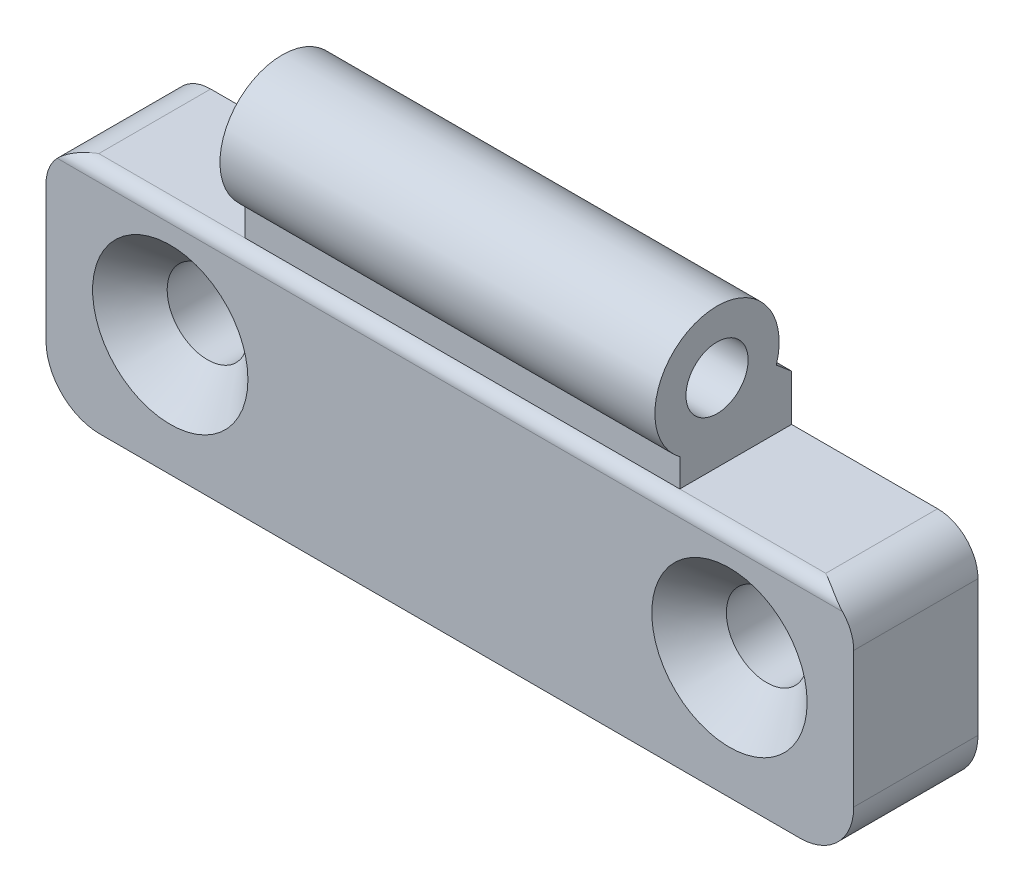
ISO-10303-21;
HEADER;
FILE_DESCRIPTION(('STEP AP214'),'2;1');
FILE_NAME('part.step','',(''),(''),'','','');
FILE_SCHEMA(('AUTOMOTIVE_DESIGN { 1 0 10303 214 1 1 1 1 }'));
ENDSEC;
DATA;
#1=APPLICATION_CONTEXT('core data for automotive mechanical design processes');
#2=APPLICATION_PROTOCOL_DEFINITION('international standard','automotive_design',2000,#1);
#3=PRODUCT_CONTEXT('',#1,'mechanical');
#4=PRODUCT('Part','Part','',(#3));
#5=PRODUCT_RELATED_PRODUCT_CATEGORY('part','',(#4));
#6=PRODUCT_DEFINITION_FORMATION('','',#4);
#7=PRODUCT_DEFINITION_CONTEXT('part definition',#1,'design');
#8=PRODUCT_DEFINITION('design','',#6,#7);
#9=PRODUCT_DEFINITION_SHAPE('','',#8);
#10=(LENGTH_UNIT() NAMED_UNIT(*) SI_UNIT(.MILLI.,.METRE.));
#11=(NAMED_UNIT(*) PLANE_ANGLE_UNIT() SI_UNIT($,.RADIAN.));
#12=(NAMED_UNIT(*) SI_UNIT($,.STERADIAN.) SOLID_ANGLE_UNIT());
#13=UNCERTAINTY_MEASURE_WITH_UNIT(LENGTH_MEASURE(1.E-05),#10,'distance_accuracy_value','');
#14=(GEOMETRIC_REPRESENTATION_CONTEXT(3) GLOBAL_UNCERTAINTY_ASSIGNED_CONTEXT((#13)) GLOBAL_UNIT_ASSIGNED_CONTEXT((#10,
#11,#12)) REPRESENTATION_CONTEXT('',''));
#15=CARTESIAN_POINT('',(0.,0.,0.));
#16=DIRECTION('',(0.,0.,1.));
#17=DIRECTION('',(1.,0.,0.));
#18=AXIS2_PLACEMENT_3D('',#15,#16,#17);
#19=CARTESIAN_POINT('',(0.,0.,9.99999999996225));
#20=DIRECTION('',(0.,0.,1.));
#21=DIRECTION('',(1.,0.,0.));
#22=AXIS2_PLACEMENT_3D('',#19,#20,#21);
#23=CONICAL_SURFACE('',#22,6.24999999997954,0.785398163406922);
#24=CARTESIAN_POINT('',(0.,0.,9.99999999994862));
#25=DIRECTION('',(0.,0.,1.));
#26=DIRECTION('',(1.,0.,0.));
#27=AXIS2_PLACEMENT_3D('',#24,#25,#26);
#28=CIRCLE('',#27,6.24999999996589);
#29=CARTESIAN_POINT('',(6.24999999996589,0.,9.99999999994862));
#30=VERTEX_POINT('',#29);
#31=EDGE_CURVE('E17',#30,#30,#28,.F.);
#32=ORIENTED_EDGE('',*,*,#31,.F.);
#33=EDGE_LOOP('',(#32));
#34=FACE_BOUND('',#33,.T.);
#35=CARTESIAN_POINT('',(0.,0.,7.));
#36=DIRECTION('',(0.,0.,-1.));
#37=DIRECTION('',(-1.,0.,0.));
#38=AXIS2_PLACEMENT_3D('',#35,#36,#37);
#39=CIRCLE('',#38,3.25);
#40=CARTESIAN_POINT('',(-3.25,0.,7.));
#41=VERTEX_POINT('',#40);
#42=EDGE_CURVE('E152',#41,#41,#39,.T.);
#43=ORIENTED_EDGE('',*,*,#42,.T.);
#44=EDGE_LOOP('',(#43));
#45=FACE_BOUND('',#44,.T.);
#46=ADVANCED_FACE('F14',(#34,#45),#23,.F.);
#47=CARTESIAN_POINT('',(45.,0.,9.99999999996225));
#48=DIRECTION('',(0.,0.,1.));
#49=DIRECTION('',(1.,0.,0.));
#50=AXIS2_PLACEMENT_3D('',#47,#48,#49);
#51=CONICAL_SURFACE('',#50,6.24999999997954,0.785398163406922);
#52=CARTESIAN_POINT('',(45.,0.,9.99999999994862));
#53=DIRECTION('',(0.,0.,1.));
#54=DIRECTION('',(1.,0.,0.));
#55=AXIS2_PLACEMENT_3D('',#52,#53,#54);
#56=CIRCLE('',#55,6.24999999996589);
#57=CARTESIAN_POINT('',(51.2499999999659,0.,9.99999999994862));
#58=VERTEX_POINT('',#57);
#59=EDGE_CURVE('E149',#58,#58,#56,.F.);
#60=ORIENTED_EDGE('',*,*,#59,.F.);
#61=EDGE_LOOP('',(#60));
#62=FACE_BOUND('',#61,.T.);
#63=CARTESIAN_POINT('',(45.,0.,7.));
#64=DIRECTION('',(0.,0.,-1.));
#65=DIRECTION('',(-1.,0.,0.));
#66=AXIS2_PLACEMENT_3D('',#63,#64,#65);
#67=CIRCLE('',#66,3.25);
#68=CARTESIAN_POINT('',(41.75,0.,7.));
#69=VERTEX_POINT('',#68);
#70=EDGE_CURVE('E175',#69,#69,#67,.T.);
#71=ORIENTED_EDGE('',*,*,#70,.T.);
#72=EDGE_LOOP('',(#71));
#73=FACE_BOUND('',#72,.T.);
#74=ADVANCED_FACE('F403',(#62,#73),#51,.F.);
#75=CARTESIAN_POINT('',(40.,15.,6.));
#76=DIRECTION('',(1.,0.,0.));
#77=DIRECTION('',(0.,1.,0.));
#78=AXIS2_PLACEMENT_3D('',#75,#76,#77);
#79=CYLINDRICAL_SURFACE('',#78,5.);
#80=DIRECTION('',(1.,0.,0.));
#81=VECTOR('',#80,1.);
#82=CARTESIAN_POINT('',(40.,11.,9.));
#83=LINE('',#82,#81);
#84=CARTESIAN_POINT('',(40.,11.,9.));
#85=VERTEX_POINT('',#84);
#86=CARTESIAN_POINT('',(5.,11.,9.));
#87=VERTEX_POINT('',#86);
#88=EDGE_CURVE('E108',#85,#87,#83,.F.);
#89=ORIENTED_EDGE('',*,*,#88,.F.);
#90=CARTESIAN_POINT('',(40.,15.,6.));
#91=DIRECTION('',(1.,0.,0.));
#92=DIRECTION('',(0.,1.,0.));
#93=AXIS2_PLACEMENT_3D('',#90,#91,#92);
#94=CIRCLE('',#93,5.);
#95=CARTESIAN_POINT('',(40.,13.5,1.23030399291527));
#96=VERTEX_POINT('',#95);
#97=EDGE_CURVE('E99',#96,#85,#94,.T.);
#98=ORIENTED_EDGE('',*,*,#97,.F.);
#99=DIRECTION('',(1.,0.,0.));
#100=VECTOR('',#99,1.);
#101=CARTESIAN_POINT('',(40.,13.5,1.23030399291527));
#102=LINE('',#101,#100);
#103=CARTESIAN_POINT('',(5.,13.5,1.23030399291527));
#104=VERTEX_POINT('',#103);
#105=EDGE_CURVE('E106',#104,#96,#102,.T.);
#106=ORIENTED_EDGE('',*,*,#105,.F.);
#107=CARTESIAN_POINT('',(5.,15.,6.));
#108=DIRECTION('',(1.,0.,0.));
#109=DIRECTION('',(0.,1.,0.));
#110=AXIS2_PLACEMENT_3D('',#107,#108,#109);
#111=CIRCLE('',#110,5.);
#112=EDGE_CURVE('E130',#104,#87,#111,.T.);
#113=ORIENTED_EDGE('',*,*,#112,.T.);
#114=EDGE_LOOP('',(#89,#98,#106,#113));
#115=FACE_BOUND('',#114,.T.);
#116=ADVANCED_FACE('F104',(#115),#79,.T.);
#117=CARTESIAN_POINT('',(40.,11.,9.));
#118=DIRECTION('',(0.,0.,1.));
#119=DIRECTION('',(1.,0.,0.));
#120=AXIS2_PLACEMENT_3D('',#117,#118,#119);
#121=PLANE('',#120);
#122=ORIENTED_EDGE('',*,*,#88,.T.);
#123=DIRECTION('',(0.,1.,0.));
#124=VECTOR('',#123,1.);
#125=CARTESIAN_POINT('',(5.,15.,9.));
#126=LINE('',#125,#124);
#127=CARTESIAN_POINT('',(5.,8.75,9.));
#128=VERTEX_POINT('',#127);
#129=EDGE_CURVE('E332',#87,#128,#126,.F.);
#130=ORIENTED_EDGE('',*,*,#129,.T.);
#131=DIRECTION('',(1.,0.,0.));
#132=VECTOR('',#131,1.);
#133=CARTESIAN_POINT('',(55.,8.75,9.));
#134=LINE('',#133,#132);
#135=CARTESIAN_POINT('',(40.,8.75,9.));
#136=VERTEX_POINT('',#135);
#137=EDGE_CURVE('E148',#136,#128,#134,.F.);
#138=ORIENTED_EDGE('',*,*,#137,.F.);
#139=DIRECTION('',(0.,1.,0.));
#140=VECTOR('',#139,1.);
#141=CARTESIAN_POINT('',(40.,15.,9.));
#142=LINE('',#141,#140);
#143=EDGE_CURVE('E110',#85,#136,#142,.F.);
#144=ORIENTED_EDGE('',*,*,#143,.F.);
#145=EDGE_LOOP('',(#122,#130,#138,#144));
#146=FACE_BOUND('',#145,.T.);
#147=ADVANCED_FACE('F350',(#146),#121,.T.);
#148=CARTESIAN_POINT('',(40.,15.,6.));
#149=DIRECTION('',(1.,0.,0.));
#150=DIRECTION('',(0.,1.,0.));
#151=AXIS2_PLACEMENT_3D('',#148,#149,#150);
#152=CYLINDRICAL_SURFACE('',#151,2.5);
#153=CARTESIAN_POINT('',(5.,15.,6.));
#154=DIRECTION('',(1.,0.,0.));
#155=DIRECTION('',(0.,1.,0.));
#156=AXIS2_PLACEMENT_3D('',#153,#154,#155);
#157=CIRCLE('',#156,2.5);
#158=CARTESIAN_POINT('',(5.,17.5,6.));
#159=VERTEX_POINT('',#158);
#160=EDGE_CURVE('E239',#159,#159,#157,.F.);
#161=ORIENTED_EDGE('',*,*,#160,.T.);
#162=EDGE_LOOP('',(#161));
#163=FACE_BOUND('',#162,.T.);
#164=CARTESIAN_POINT('',(40.,15.,6.));
#165=DIRECTION('',(1.,0.,0.));
#166=DIRECTION('',(0.,1.,0.));
#167=AXIS2_PLACEMENT_3D('',#164,#165,#166);
#168=CIRCLE('',#167,2.5);
#169=CARTESIAN_POINT('',(40.,17.5,6.));
#170=VERTEX_POINT('',#169);
#171=EDGE_CURVE('E111',#170,#170,#168,.F.);
#172=ORIENTED_EDGE('',*,*,#171,.F.);
#173=EDGE_LOOP('',(#172));
#174=FACE_BOUND('',#173,.T.);
#175=ADVANCED_FACE('F418',(#163,#174),#152,.F.);
#176=CARTESIAN_POINT('',(22.5,15.,10.));
#177=DIRECTION('',(0.,0.,1.));
#178=DIRECTION('',(1.,0.,0.));
#179=AXIS2_PLACEMENT_3D('',#176,#177,#178);
#180=PLANE('',#179);
#181=CARTESIAN_POINT('',(51.75,5.5,10.));
#182=DIRECTION('',(0.,0.,-1.));
#183=DIRECTION('',(-1.,0.,0.));
#184=AXIS2_PLACEMENT_3D('',#181,#182,#183);
#185=CIRCLE('',#184,3.25);
#186=CARTESIAN_POINT('',(54.0952078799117,7.75,10.));
#187=VERTEX_POINT('',#186);
#188=CARTESIAN_POINT('',(55.,5.5,10.));
#189=VERTEX_POINT('',#188);
#190=EDGE_CURVE('E201',#187,#189,#185,.T.);
#191=ORIENTED_EDGE('',*,*,#190,.F.);
#192=DIRECTION('',(1.,0.,0.));
#193=VECTOR('',#192,1.);
#194=CARTESIAN_POINT('',(55.,7.75,10.));
#195=LINE('',#194,#193);
#196=CARTESIAN_POINT('',(-9.0952078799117,7.75,10.));
#197=VERTEX_POINT('',#196);
#198=EDGE_CURVE('E146',#197,#187,#195,.T.);
#199=ORIENTED_EDGE('',*,*,#198,.F.);
#200=CARTESIAN_POINT('',(-6.75,5.5,10.));
#201=DIRECTION('',(0.,0.,-1.));
#202=DIRECTION('',(-1.,0.,0.));
#203=AXIS2_PLACEMENT_3D('',#200,#201,#202);
#204=CIRCLE('',#203,3.25);
#205=CARTESIAN_POINT('',(-10.,5.5,10.));
#206=VERTEX_POINT('',#205);
#207=EDGE_CURVE('E166',#206,#197,#204,.T.);
#208=ORIENTED_EDGE('',*,*,#207,.F.);
#209=DIRECTION('',(0.,-1.,0.));
#210=VECTOR('',#209,1.);
#211=CARTESIAN_POINT('',(-10.,-5.4166666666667,10.));
#212=LINE('',#211,#210);
#213=CARTESIAN_POINT('',(-10.,-5.4166666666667,10.));
#214=VERTEX_POINT('',#213);
#215=EDGE_CURVE('E163',#214,#206,#212,.F.);
#216=ORIENTED_EDGE('',*,*,#215,.F.);
#217=CARTESIAN_POINT('',(-5.6666666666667,-5.4166666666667,10.));
#218=DIRECTION('',(0.,0.,-1.));
#219=DIRECTION('',(-1.,0.,0.));
#220=AXIS2_PLACEMENT_3D('',#217,#218,#219);
#221=CIRCLE('',#220,4.33333333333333);
#222=CARTESIAN_POINT('',(-5.6666666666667,-9.75,10.));
#223=VERTEX_POINT('',#222);
#224=EDGE_CURVE('E321',#223,#214,#221,.T.);
#225=ORIENTED_EDGE('',*,*,#224,.F.);
#226=DIRECTION('',(1.,0.,0.));
#227=VECTOR('',#226,1.);
#228=CARTESIAN_POINT('',(50.6666666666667,-9.75,10.));
#229=LINE('',#228,#227);
#230=CARTESIAN_POINT('',(50.6666666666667,-9.75,10.));
#231=VERTEX_POINT('',#230);
#232=EDGE_CURVE('E159',#231,#223,#229,.F.);
#233=ORIENTED_EDGE('',*,*,#232,.F.);
#234=CARTESIAN_POINT('',(50.6666666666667,-5.4166666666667,10.));
#235=DIRECTION('',(0.,0.,-1.));
#236=DIRECTION('',(-1.,0.,0.));
#237=AXIS2_PLACEMENT_3D('',#234,#235,#236);
#238=CIRCLE('',#237,4.33333333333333);
#239=CARTESIAN_POINT('',(55.,-5.4166666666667,10.));
#240=VERTEX_POINT('',#239);
#241=EDGE_CURVE('E213',#240,#231,#238,.T.);
#242=ORIENTED_EDGE('',*,*,#241,.F.);
#243=DIRECTION('',(0.,1.,0.));
#244=VECTOR('',#243,1.);
#245=CARTESIAN_POINT('',(55.,5.5,10.));
#246=LINE('',#245,#244);
#247=EDGE_CURVE('E155',#189,#240,#246,.F.);
#248=ORIENTED_EDGE('',*,*,#247,.F.);
#249=EDGE_LOOP('',(#191,#199,#208,#216,#225,#233,#242,#248));
#250=FACE_BOUND('',#249,.T.);
#251=ORIENTED_EDGE('',*,*,#59,.T.);
#252=EDGE_LOOP('',(#251));
#253=FACE_BOUND('',#252,.T.);
#254=ORIENTED_EDGE('',*,*,#31,.T.);
#255=EDGE_LOOP('',(#254));
#256=FACE_BOUND('',#255,.T.);
#257=ADVANCED_FACE('F225',(#250,#253,#256),#180,.T.);
#258=CARTESIAN_POINT('',(55.,7.75,9.));
#259=DIRECTION('',(1.,0.,0.));
#260=DIRECTION('',(0.,1.,0.));
#261=AXIS2_PLACEMENT_3D('',#258,#259,#260);
#262=CYLINDRICAL_SURFACE('',#261,1.);
#263=ORIENTED_EDGE('',*,*,#137,.T.);
#264=DIRECTION('',(-1.,0.,0.));
#265=VECTOR('',#264,1.);
#266=CARTESIAN_POINT('',(-6.75,8.75,9.));
#267=LINE('',#266,#265);
#268=CARTESIAN_POINT('',(-6.75,8.75,9.));
#269=VERTEX_POINT('',#268);
#270=EDGE_CURVE('E167',#269,#128,#267,.F.);
#271=ORIENTED_EDGE('',*,*,#270,.F.);
#272=CARTESIAN_POINT('',(-9.0952078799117,7.75,10.));
#273=CARTESIAN_POINT('',(-9.05730541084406,7.7895153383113,9.9999877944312));
#274=CARTESIAN_POINT('',(-9.01844303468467,7.82801385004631,9.99766050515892));
#275=CARTESIAN_POINT('',(-8.9391426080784,7.90272925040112,9.98898430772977));
#276=CARTESIAN_POINT('',(-8.89870771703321,7.93895036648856,9.9826431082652));
#277=CARTESIAN_POINT('',(-8.77612768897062,8.04337299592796,9.95864810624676));
#278=CARTESIAN_POINT('',(-8.69196734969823,8.10810030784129,9.93599885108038));
#279=CARTESIAN_POINT('',(-8.54229248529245,8.21223956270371,9.88809834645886));
#280=CARTESIAN_POINT('',(-8.47756518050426,8.25387573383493,9.86502360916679));
#281=CARTESIAN_POINT('',(-8.34656824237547,8.33183254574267,9.81463038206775));
#282=CARTESIAN_POINT('',(-8.28029817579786,8.3681516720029,9.78731068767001));
#283=CARTESIAN_POINT('',(-8.07896601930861,8.46968556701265,9.70004516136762));
#284=CARTESIAN_POINT('',(-7.94205678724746,8.52701481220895,9.63502639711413));
#285=CARTESIAN_POINT('',(-7.71806304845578,8.60380340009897,9.52318018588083));
#286=CARTESIAN_POINT('',(-7.63173288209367,8.62938347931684,9.47878152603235));
#287=CARTESIAN_POINT('',(-7.45833118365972,8.67313159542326,9.38778607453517));
#288=CARTESIAN_POINT('',(-7.37125941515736,8.69129717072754,9.34118855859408));
#289=CARTESIAN_POINT('',(-7.10989463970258,8.73482587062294,9.199610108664));
#290=CARTESIAN_POINT('',(-6.93477453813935,8.74944876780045,9.10249403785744));
#291=CARTESIAN_POINT('',(-6.75664691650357,8.74999489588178,9.00368703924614));
#292=CARTESIAN_POINT('',(-6.75332339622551,8.74999999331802,9.00184348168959));
#293=CARTESIAN_POINT('',(-6.75,8.75,9.));
#294=B_SPLINE_CURVE_WITH_KNOTS('',3,(#272,#273,#274,#275,#276,#277,#278,#279,#280,#281,#282,
#283,#284,#285,#286,#287,#288,#289,#290,#291,#292,#293),.UNSPECIFIED.,.F.,.F.,(4,2,2,2,2,2,2,2,
2,2,4),(0.,0.164087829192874,0.327861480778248,0.652251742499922,0.893004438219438,
1.13382557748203,1.61798965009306,1.91890595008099,2.21992207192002,2.81958905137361,
2.83099081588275),.UNSPECIFIED.);
#295=EDGE_CURVE('E170',#197,#269,#294,.T.);
#296=ORIENTED_EDGE('',*,*,#295,.F.);
#297=ORIENTED_EDGE('',*,*,#198,.T.);
#298=CARTESIAN_POINT('',(51.75,8.75,9.));
#299=CARTESIAN_POINT('',(51.750000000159,8.75,9.00000117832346));
#300=CARTESIAN_POINT('',(51.7500001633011,8.74999999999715,9.00000235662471));
#301=CARTESIAN_POINT('',(51.7500007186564,8.74999999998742,9.00000466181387));
#302=CARTESIAN_POINT('',(51.7500011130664,8.74999999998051,9.00000578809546));
#303=CARTESIAN_POINT('',(51.7500020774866,8.7499999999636,9.00000801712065));
#304=CARTESIAN_POINT('',(51.7500026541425,8.74999999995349,9.00000911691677));
#305=CARTESIAN_POINT('',(51.7500039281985,8.74999999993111,9.00001123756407));
#306=CARTESIAN_POINT('',(51.7500046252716,8.74999999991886,9.00001225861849));
#307=CARTESIAN_POINT('',(51.7500070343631,8.74999999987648,9.00001550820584));
#308=CARTESIAN_POINT('',(51.7500089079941,8.74999999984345,9.00001761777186));
#309=CARTESIAN_POINT('',(51.750012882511,8.74999999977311,9.00002152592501));
#310=CARTESIAN_POINT('',(51.7500149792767,8.74999999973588,9.0000233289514));
#311=CARTESIAN_POINT('',(51.7500227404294,8.74999999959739,9.00002964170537));
#312=CARTESIAN_POINT('',(51.7500286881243,8.74999999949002,9.00003381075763));
#313=CARTESIAN_POINT('',(51.7500407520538,8.74999999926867,9.00004104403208));
#314=CARTESIAN_POINT('',(51.750046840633,8.7499999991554,9.00004415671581));
#315=CARTESIAN_POINT('',(51.7500714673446,8.74999999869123,9.00005650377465));
#316=CARTESIAN_POINT('',(51.7500901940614,8.74999999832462,9.00006534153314));
#317=CARTESIAN_POINT('',(51.7501260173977,8.74999999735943,9.00008036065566));
#318=CARTESIAN_POINT('',(51.7501430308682,8.74999999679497,9.0000867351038));
#319=CARTESIAN_POINT('',(51.7502605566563,8.74999999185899,9.00013459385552));
#320=CARTESIAN_POINT('',(51.750353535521,8.74999998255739,9.00019236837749));
#321=CARTESIAN_POINT('',(51.7507067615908,8.74999993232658,9.00040313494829));
#322=CARTESIAN_POINT('',(51.7509723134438,8.74999986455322,9.00054402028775));
#323=CARTESIAN_POINT('',(51.751973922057,8.74999948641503,9.00108409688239));
#324=CARTESIAN_POINT('',(51.7527045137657,8.74999895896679,9.00149587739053));
#325=CARTESIAN_POINT('',(51.755609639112,8.74999587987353,9.00312450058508));
#326=CARTESIAN_POINT('',(51.7577901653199,8.74999138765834,9.00432740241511));
#327=CARTESIAN_POINT('',(51.8142959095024,8.74981822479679,9.03551019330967));
#328=CARTESIAN_POINT('',(51.8685340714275,8.74829247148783,9.06570560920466));
#329=CARTESIAN_POINT('',(51.9752670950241,8.7426091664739,9.12484934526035));
#330=CARTESIAN_POINT('',(52.0277621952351,8.73853740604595,9.15380664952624));
#331=CARTESIAN_POINT('',(52.138025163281,8.72727707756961,9.21440766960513));
#332=CARTESIAN_POINT('',(52.1957815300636,8.71981163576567,9.24602225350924));
#333=CARTESIAN_POINT('',(52.3116164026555,8.70164845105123,9.3089473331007));
#334=CARTESIAN_POINT('',(52.3696933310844,8.69092311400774,9.34025277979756));
#335=CARTESIAN_POINT('',(52.4726690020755,8.66896978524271,9.39517476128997));
#336=CARTESIAN_POINT('',(52.5176206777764,8.65838628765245,9.41895027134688));
#337=CARTESIAN_POINT('',(52.6072273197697,8.63525089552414,9.46584668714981));
#338=CARTESIAN_POINT('',(52.6518827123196,8.622703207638,9.4889688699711));
#339=CARTESIAN_POINT('',(52.7838215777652,8.58254100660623,9.5563986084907));
#340=CARTESIAN_POINT('',(52.8707827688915,8.55204531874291,9.59968582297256));
#341=CARTESIAN_POINT('',(53.0153504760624,8.49421605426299,9.66892817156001));
#342=CARTESIAN_POINT('',(53.0733294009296,8.46906521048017,9.69595094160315));
#343=CARTESIAN_POINT('',(53.1887786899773,8.41487555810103,9.74790084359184));
#344=CARTESIAN_POINT('',(53.2462457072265,8.38582017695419,9.77281826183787));
#345=CARTESIAN_POINT('',(53.3626154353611,8.32250617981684,9.8209038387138));
#346=CARTESIAN_POINT('',(53.4214764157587,8.28807974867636,9.84395383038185));
#347=CARTESIAN_POINT('',(53.5377651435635,8.21497829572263,9.88632781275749));
#348=CARTESIAN_POINT('',(53.5951947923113,8.17630932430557,9.90565700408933));
#349=CARTESIAN_POINT('',(53.7325786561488,8.07716921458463,9.94707942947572));
#350=CARTESIAN_POINT('',(53.8116625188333,8.01444633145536,9.96681970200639));
#351=CARTESIAN_POINT('',(53.9641010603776,7.88125053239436,9.99364572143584));
#352=CARTESIAN_POINT('',(54.0375069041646,7.81086530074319,10.0008613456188));
#353=CARTESIAN_POINT('',(54.1590949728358,7.68275441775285,9.99922091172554));
#354=CARTESIAN_POINT('',(54.2088674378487,7.62650578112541,9.99406109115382));
#355=CARTESIAN_POINT('',(54.3035682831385,7.51178953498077,9.97295942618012));
#356=CARTESIAN_POINT('',(54.3484947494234,7.453321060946,9.95701333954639));
#357=CARTESIAN_POINT('',(54.4247440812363,7.34708824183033,9.91667212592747));
#358=CARTESIAN_POINT('',(54.4570632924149,7.2992779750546,9.89429577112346));
#359=CARTESIAN_POINT('',(54.5169680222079,7.20571577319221,9.84062859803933));
#360=CARTESIAN_POINT('',(54.5445566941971,7.15996248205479,9.8093437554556));
#361=CARTESIAN_POINT('',(54.5947264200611,7.07244933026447,9.73765989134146));
#362=CARTESIAN_POINT('',(54.6172752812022,7.0307160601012,9.69720542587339));
#363=CARTESIAN_POINT('',(54.6569565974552,6.95395246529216,9.60808018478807));
#364=CARTESIAN_POINT('',(54.6740907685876,6.9189200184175,9.55941201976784));
#365=CARTESIAN_POINT('',(54.7014522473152,6.86100920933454,9.46107729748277));
#366=CARTESIAN_POINT('',(54.7122281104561,6.83722330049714,9.41209515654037));
#367=CARTESIAN_POINT('',(54.7297159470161,6.797791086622,9.31028193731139));
#368=CARTESIAN_POINT('',(54.7364292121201,6.78214219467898,9.2574520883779));
#369=CARTESIAN_POINT('',(54.7457170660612,6.76028307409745,9.15231432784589));
#370=CARTESIAN_POINT('',(54.748482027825,6.75363952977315,9.10011269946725));
#371=CARTESIAN_POINT('',(54.750569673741,6.74863517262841,8.99524785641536));
#372=CARTESIAN_POINT('',(54.7498927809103,6.75027334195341,8.94258469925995));
#373=CARTESIAN_POINT('',(54.7451041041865,6.76170045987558,8.83889265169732));
#374=CARTESIAN_POINT('',(54.7410296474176,6.77140082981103,8.78785223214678));
#375=CARTESIAN_POINT('',(54.7293931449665,6.79843412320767,8.68825570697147));
#376=CARTESIAN_POINT('',(54.7218312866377,6.81576663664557,8.63969946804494));
#377=CARTESIAN_POINT('',(54.70303954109,6.85741604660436,8.54621298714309));
#378=CARTESIAN_POINT('',(54.6917952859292,6.8817602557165,8.50129782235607));
#379=CARTESIAN_POINT('',(54.6655269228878,6.93635552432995,8.41645198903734));
#380=CARTESIAN_POINT('',(54.650502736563,6.96660670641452,8.37652142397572));
#381=CARTESIAN_POINT('',(54.6162062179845,7.03257126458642,8.30153498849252));
#382=CARTESIAN_POINT('',(54.5968345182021,7.06840516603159,8.26663099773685));
#383=CARTESIAN_POINT('',(54.5541983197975,7.14342108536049,8.20346430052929));
#384=CARTESIAN_POINT('',(54.5309333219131,7.1826035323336,8.17520244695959));
#385=CARTESIAN_POINT('',(54.4788589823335,7.26590351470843,8.12351113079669));
#386=CARTESIAN_POINT('',(54.4497624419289,7.31016969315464,8.10061311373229));
#387=CARTESIAN_POINT('',(54.3878223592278,7.39930311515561,8.06225140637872));
#388=CARTESIAN_POINT('',(54.3549750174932,7.44417092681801,8.04679533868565));
#389=CARTESIAN_POINT('',(54.2701213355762,7.5538339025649,8.01711213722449));
#390=CARTESIAN_POINT('',(54.2162745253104,7.61825889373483,8.00675166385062));
#391=CARTESIAN_POINT('',(54.1034197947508,7.74299627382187,7.99806667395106));
#392=CARTESIAN_POINT('',(54.0444133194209,7.80330980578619,7.99973879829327));
#393=CARTESIAN_POINT('',(53.8971239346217,7.94262986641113,8.01529312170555));
#394=CARTESIAN_POINT('',(53.806863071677,8.01899156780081,8.03395966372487));
#395=CARTESIAN_POINT('',(53.6199229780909,8.16081113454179,8.08511775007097));
#396=CARTESIAN_POINT('',(53.5231687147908,8.22609155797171,8.11780914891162));
#397=CARTESIAN_POINT('',(53.3494770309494,8.33052583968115,8.18400406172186));
#398=CARTESIAN_POINT('',(53.2732539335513,8.37220929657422,8.21549370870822));
#399=CARTESIAN_POINT('',(53.1191347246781,8.44879473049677,8.28285773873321));
#400=CARTESIAN_POINT('',(53.0412354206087,8.48368220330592,8.31874123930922));
#401=CARTESIAN_POINT('',(52.8890101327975,8.54491064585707,8.39152526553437));
#402=CARTESIAN_POINT('',(52.8147474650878,8.57163673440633,8.42823810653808));
#403=CARTESIAN_POINT('',(52.6659855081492,8.61921919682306,8.50358292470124));
#404=CARTESIAN_POINT('',(52.5914909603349,8.64011289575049,8.54220074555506));
#405=CARTESIAN_POINT('',(52.4619813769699,8.67155458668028,8.61045314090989));
#406=CARTESIAN_POINT('',(52.4070811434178,8.68337518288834,8.63973024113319));
#407=CARTESIAN_POINT('',(52.2958918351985,8.70433625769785,8.69955351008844));
#408=CARTESIAN_POINT('',(52.2395982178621,8.71341384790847,8.73011342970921));
#409=CARTESIAN_POINT('',(52.1463818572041,8.72595159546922,8.78102876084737));
#410=CARTESIAN_POINT('',(52.1095002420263,8.73026850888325,8.80125407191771));
#411=CARTESIAN_POINT('',(52.036010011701,8.7375995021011,8.84168076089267));
#412=CARTESIAN_POINT('',(51.9994017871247,8.74062450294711,8.86188083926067));
#413=CARTESIAN_POINT('',(51.9295353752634,8.74520810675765,8.90048050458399));
#414=CARTESIAN_POINT('',(51.8962805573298,8.74687647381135,8.91887378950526));
#415=CARTESIAN_POINT('',(51.8286924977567,8.74922916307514,8.95637649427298));
#416=CARTESIAN_POINT('',(51.794359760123,8.74987931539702,8.97548957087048));
#417=CARTESIAN_POINT('',(51.757791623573,8.74999138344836,8.9956719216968));
#418=CARTESIAN_POINT('',(51.7556124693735,8.74999587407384,8.99687396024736));
#419=CARTESIAN_POINT('',(51.7527077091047,8.7499989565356,8.99850234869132));
#420=CARTESIAN_POINT('',(51.7519760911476,8.74999948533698,8.99891471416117));
#421=CARTESIAN_POINT('',(51.750973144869,8.74999986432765,8.99945551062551));
#422=CARTESIAN_POINT('',(51.7507072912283,8.74999993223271,8.99959655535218));
#423=CARTESIAN_POINT('',(51.7503537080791,8.74999998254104,8.99980753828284));
#424=CARTESIAN_POINT('',(51.7502606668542,8.74999999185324,8.99986535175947));
#425=CARTESIAN_POINT('',(51.750143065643,8.74999999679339,8.99991323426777));
#426=CARTESIAN_POINT('',(51.7501260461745,8.74999999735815,8.99991960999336));
#427=CARTESIAN_POINT('',(51.750090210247,8.74999999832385,8.99993463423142));
#428=CARTESIAN_POINT('',(51.7500714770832,8.74999999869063,8.99994347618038));
#429=CARTESIAN_POINT('',(51.7500468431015,8.74999999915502,8.9999558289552));
#430=CARTESIAN_POINT('',(51.7500407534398,8.74999999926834,8.99995894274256));
#431=CARTESIAN_POINT('',(51.7500286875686,8.74999999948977,8.99996617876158));
#432=CARTESIAN_POINT('',(51.7500227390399,8.74999999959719,8.99997034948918));
#433=CARTESIAN_POINT('',(51.7500149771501,8.74999999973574,8.9999766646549));
#434=CARTESIAN_POINT('',(51.7500128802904,8.74999999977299,8.99997846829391));
#435=CARTESIAN_POINT('',(51.7500089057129,8.74999999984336,8.99998237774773));
#436=CARTESIAN_POINT('',(51.750007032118,8.7499999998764,8.99998448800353));
#437=CARTESIAN_POINT('',(51.7500046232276,8.7499999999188,8.99998773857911));
#438=CARTESIAN_POINT('',(51.7500039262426,8.74999999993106,8.9999887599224));
#439=CARTESIAN_POINT('',(51.7500026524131,8.74999999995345,8.99999088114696));
#440=CARTESIAN_POINT('',(51.7500020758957,8.74999999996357,8.99999198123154));
#441=CARTESIAN_POINT('',(51.7500011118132,8.7499999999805,8.99999421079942));
#442=CARTESIAN_POINT('',(51.7500007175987,8.74999999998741,8.99999533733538));
#443=CARTESIAN_POINT('',(51.7500001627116,8.74999999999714,8.99999764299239));
#444=CARTESIAN_POINT('',(51.7499999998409,8.75,8.9999988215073));
#445=CARTESIAN_POINT('',(51.75,8.75,9.));
#446=B_SPLINE_CURVE_WITH_KNOTS('',3,(#298,#299,#300,#301,#302,#303,#304,#305,#306,#307,#308,
#309,#310,#311,#312,#313,#314,#315,#316,#317,#318,#319,#320,#321,#322,#323,#324,#325,#326,#327,
#328,#329,#330,#331,#332,#333,#334,#335,#336,#337,#338,#339,#340,#341,#342,#343,#344,#345,#346,
#347,#348,#349,#350,#351,#352,#353,#354,#355,#356,#357,#358,#359,#360,#361,#362,#363,#364,#365,
#366,#367,#368,#369,#370,#371,#372,#373,#374,#375,#376,#377,#378,#379,#380,#381,#382,#383,#384,
#385,#386,#387,#388,#389,#390,#391,#392,#393,#394,#395,#396,#397,#398,#399,#400,#401,#402,#403,
#404,#405,#406,#407,#408,#409,#410,#411,#412,#413,#414,#415,#416,#417,#418,#419,#420,#421,#422,
#423,#424,#425,#426,#427,#428,#429,#430,#431,#432,#433,#434,#435,#436,#437,#438,#439,#440,#441,
#442,#443,#444,#445),.UNSPECIFIED.,.T.,.F.,(4,2,2,2,2,2,2,2,2,2,2,2,2,2,2,2,2,2,2,2,2,2,2,2,2,2,
2,2,2,2,2,2,2,2,2,2,2,2,2,2,2,2,2,2,2,2,2,2,2,2,2,2,2,2,2,2,2,2,2,2,2,2,2,2,2,2,2,2,2,2,2,2,2,
4),(0.,3.53115691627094E-06,7.09641137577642E-06,1.08105630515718E-05,1.45147823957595E-05,
2.29382984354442E-05,3.1226912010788E-05,5.29263216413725E-05,7.34219142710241E-05,
0.000135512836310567,0.00018995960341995,0.000516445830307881,0.00141973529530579,
0.00393389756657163,0.0114065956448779,0.19759245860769,0.377819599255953,0.576534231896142,
0.776980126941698,0.932762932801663,1.08821655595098,1.39323247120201,1.59931412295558,
1.80629986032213,2.02201901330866,2.23743442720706,2.5449721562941,2.84930131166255,
3.07437204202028,3.29953134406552,3.48445927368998,3.66926344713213,3.85521634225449,
4.04111024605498,4.20678395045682,4.37240495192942,4.52973428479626,4.6870442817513,
4.84264842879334,4.99824421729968,5.15445448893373,5.3106680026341,5.4709013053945,
5.63115517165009,5.80360488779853,5.97623086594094,6.22860879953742,6.48091627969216,
6.83805128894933,7.20045395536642,7.47729774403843,7.75472605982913,8.01564030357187,
8.27484437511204,8.46477475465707,8.65877682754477,8.78561256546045,8.91135380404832,
9.02546329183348,9.14332582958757,9.15079369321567,9.15331139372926,9.15421570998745,
9.15454241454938,9.15459687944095,9.15465899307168,9.15467949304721,9.15470119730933,
9.15470948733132,9.15471791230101,9.15472161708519,9.15472533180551,9.15472889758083,
9.15473242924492),.UNSPECIFIED.);
#447=CARTESIAN_POINT('',(51.75,8.75,9.));
#448=VERTEX_POINT('',#447);
#449=EDGE_CURVE('E204',#448,#187,#446,.T.);
#450=ORIENTED_EDGE('',*,*,#449,.F.);
#451=DIRECTION('',(-1.,0.,0.));
#452=VECTOR('',#451,1.);
#453=CARTESIAN_POINT('',(-6.75,8.75,9.));
#454=LINE('',#453,#452);
#455=EDGE_CURVE('E141',#136,#448,#454,.F.);
#456=ORIENTED_EDGE('',*,*,#455,.F.);
#457=EDGE_LOOP('',(#263,#271,#296,#297,#450,#456));
#458=FACE_BOUND('',#457,.T.);
#459=ADVANCED_FACE('F219',(#458),#262,.T.);
#460=CARTESIAN_POINT('',(0.,0.,3.5));
#461=DIRECTION('',(0.,0.,-1.));
#462=DIRECTION('',(-1.,0.,0.));
#463=AXIS2_PLACEMENT_3D('',#460,#461,#462);
#464=CYLINDRICAL_SURFACE('',#463,3.25);
#465=ORIENTED_EDGE('',*,*,#42,.F.);
#466=EDGE_LOOP('',(#465));
#467=FACE_BOUND('',#466,.T.);
#468=CARTESIAN_POINT('',(0.,0.,0.));
#469=DIRECTION('',(0.,0.,-1.));
#470=DIRECTION('',(-1.,0.,0.));
#471=AXIS2_PLACEMENT_3D('',#468,#469,#470);
#472=CIRCLE('',#471,3.25);
#473=CARTESIAN_POINT('',(-3.25,0.,0.));
#474=VERTEX_POINT('',#473);
#475=EDGE_CURVE('E198',#474,#474,#472,.T.);
#476=ORIENTED_EDGE('',*,*,#475,.T.);
#477=EDGE_LOOP('',(#476));
#478=FACE_BOUND('',#477,.T.);
#479=ADVANCED_FACE('F224',(#467,#478),#464,.F.);
#480=CARTESIAN_POINT('',(45.,0.,3.5));
#481=DIRECTION('',(0.,0.,-1.));
#482=DIRECTION('',(-1.,0.,0.));
#483=AXIS2_PLACEMENT_3D('',#480,#481,#482);
#484=CYLINDRICAL_SURFACE('',#483,3.25);
#485=ORIENTED_EDGE('',*,*,#70,.F.);
#486=EDGE_LOOP('',(#485));
#487=FACE_BOUND('',#486,.T.);
#488=CARTESIAN_POINT('',(45.,0.,0.));
#489=DIRECTION('',(0.,0.,-1.));
#490=DIRECTION('',(-1.,0.,0.));
#491=AXIS2_PLACEMENT_3D('',#488,#489,#490);
#492=CIRCLE('',#491,3.25);
#493=CARTESIAN_POINT('',(41.75,0.,0.));
#494=VERTEX_POINT('',#493);
#495=EDGE_CURVE('E195',#494,#494,#492,.T.);
#496=ORIENTED_EDGE('',*,*,#495,.T.);
#497=EDGE_LOOP('',(#496));
#498=FACE_BOUND('',#497,.T.);
#499=ADVANCED_FACE('F260',(#487,#498),#484,.F.);
#500=CARTESIAN_POINT('',(40.,15.,0.));
#501=DIRECTION('',(1.,0.,0.));
#502=DIRECTION('',(0.,1.,0.));
#503=AXIS2_PLACEMENT_3D('',#500,#501,#502);
#504=PLANE('',#503);
#505=ORIENTED_EDGE('',*,*,#97,.T.);
#506=ORIENTED_EDGE('',*,*,#143,.T.);
#507=DIRECTION('',(0.,0.,1.));
#508=VECTOR('',#507,1.);
#509=CARTESIAN_POINT('',(40.,8.75,0.));
#510=LINE('',#509,#508);
#511=CARTESIAN_POINT('',(40.,8.75,0.));
#512=VERTEX_POINT('',#511);
#513=EDGE_CURVE('E143',#512,#136,#510,.T.);
#514=ORIENTED_EDGE('',*,*,#513,.F.);
#515=DIRECTION('',(0.,1.,0.));
#516=VECTOR('',#515,1.);
#517=CARTESIAN_POINT('',(40.,15.,0.));
#518=LINE('',#517,#516);
#519=CARTESIAN_POINT('',(40.,12.4676523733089,0.));
#520=VERTEX_POINT('',#519);
#521=EDGE_CURVE('E128',#512,#520,#518,.T.);
#522=ORIENTED_EDGE('',*,*,#521,.T.);
#523=DIRECTION('',(0.,0.64278760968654,0.766044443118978));
#524=VECTOR('',#523,1.);
#525=CARTESIAN_POINT('',(40.,12.4676523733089,0.));
#526=LINE('',#525,#524);
#527=EDGE_CURVE('E118',#96,#520,#526,.F.);
#528=ORIENTED_EDGE('',*,*,#527,.F.);
#529=EDGE_LOOP('',(#505,#506,#514,#522,#528));
#530=FACE_BOUND('',#529,.T.);
#531=ORIENTED_EDGE('',*,*,#171,.T.);
#532=EDGE_LOOP('',(#531));
#533=FACE_BOUND('',#532,.T.);
#534=ADVANCED_FACE('F124',(#530,#533),#504,.T.);
#535=CARTESIAN_POINT('',(40.,12.4676523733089,0.));
#536=DIRECTION('',(0.,0.766044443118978,-0.64278760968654));
#537=DIRECTION('',(0.,0.64278760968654,0.766044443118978));
#538=AXIS2_PLACEMENT_3D('',#535,#536,#537);
#539=PLANE('',#538);
#540=ORIENTED_EDGE('',*,*,#527,.T.);
#541=DIRECTION('',(1.,0.,0.));
#542=VECTOR('',#541,1.);
#543=CARTESIAN_POINT('',(22.5,12.4676523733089,0.));
#544=LINE('',#543,#542);
#545=CARTESIAN_POINT('',(5.,12.4676523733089,0.));
#546=VERTEX_POINT('',#545);
#547=EDGE_CURVE('E313',#520,#546,#544,.F.);
#548=ORIENTED_EDGE('',*,*,#547,.T.);
#549=DIRECTION('',(0.,0.64278760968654,0.766044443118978));
#550=VECTOR('',#549,1.);
#551=CARTESIAN_POINT('',(5.,12.4676523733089,0.));
#552=LINE('',#551,#550);
#553=EDGE_CURVE('E121',#546,#104,#552,.T.);
#554=ORIENTED_EDGE('',*,*,#553,.T.);
#555=ORIENTED_EDGE('',*,*,#105,.T.);
#556=EDGE_LOOP('',(#540,#548,#554,#555));
#557=FACE_BOUND('',#556,.T.);
#558=ADVANCED_FACE('F115',(#557),#539,.T.);
#559=CARTESIAN_POINT('',(5.,15.,0.));
#560=DIRECTION('',(1.,0.,0.));
#561=DIRECTION('',(0.,1.,0.));
#562=AXIS2_PLACEMENT_3D('',#559,#560,#561);
#563=PLANE('',#562);
#564=ORIENTED_EDGE('',*,*,#160,.F.);
#565=EDGE_LOOP('',(#564));
#566=FACE_BOUND('',#565,.T.);
#567=ORIENTED_EDGE('',*,*,#129,.F.);
#568=ORIENTED_EDGE('',*,*,#112,.F.);
#569=ORIENTED_EDGE('',*,*,#553,.F.);
#570=DIRECTION('',(0.,1.,0.));
#571=VECTOR('',#570,1.);
#572=CARTESIAN_POINT('',(5.,15.,0.));
#573=LINE('',#572,#571);
#574=CARTESIAN_POINT('',(5.,8.75,0.));
#575=VERTEX_POINT('',#574);
#576=EDGE_CURVE('E304',#546,#575,#573,.F.);
#577=ORIENTED_EDGE('',*,*,#576,.T.);
#578=DIRECTION('',(0.,0.,1.));
#579=VECTOR('',#578,1.);
#580=CARTESIAN_POINT('',(5.,8.75,0.));
#581=LINE('',#580,#579);
#582=EDGE_CURVE('E171',#128,#575,#581,.F.);
#583=ORIENTED_EDGE('',*,*,#582,.F.);
#584=EDGE_LOOP('',(#567,#568,#569,#577,#583));
#585=FACE_BOUND('',#584,.T.);
#586=ADVANCED_FACE('F252',(#566,#585),#563,.F.);
#587=CARTESIAN_POINT('',(-6.75,8.75,0.));
#588=DIRECTION('',(0.,1.,0.));
#589=DIRECTION('',(-1.,0.,0.));
#590=AXIS2_PLACEMENT_3D('',#587,#588,#589);
#591=PLANE('',#590);
#592=DIRECTION('',(0.,0.,-1.));
#593=VECTOR('',#592,1.);
#594=CARTESIAN_POINT('',(-6.75,8.75,0.));
#595=LINE('',#594,#593);
#596=CARTESIAN_POINT('',(-6.75,8.75,0.));
#597=VERTEX_POINT('',#596);
#598=EDGE_CURVE('E238',#269,#597,#595,.T.);
#599=ORIENTED_EDGE('',*,*,#598,.F.);
#600=ORIENTED_EDGE('',*,*,#270,.T.);
#601=ORIENTED_EDGE('',*,*,#582,.T.);
#602=DIRECTION('',(1.,0.,0.));
#603=VECTOR('',#602,1.);
#604=CARTESIAN_POINT('',(22.5,8.75,0.));
#605=LINE('',#604,#603);
#606=EDGE_CURVE('E194',#575,#597,#605,.F.);
#607=ORIENTED_EDGE('',*,*,#606,.T.);
#608=EDGE_LOOP('',(#599,#600,#601,#607));
#609=FACE_BOUND('',#608,.T.);
#610=ADVANCED_FACE('F247',(#609),#591,.T.);
#611=CARTESIAN_POINT('',(-6.75,5.5,0.));
#612=DIRECTION('',(0.,0.,-1.));
#613=DIRECTION('',(-1.,0.,0.));
#614=AXIS2_PLACEMENT_3D('',#611,#612,#613);
#615=CYLINDRICAL_SURFACE('',#614,3.25);
#616=DIRECTION('',(0.,0.,1.));
#617=VECTOR('',#616,1.);
#618=CARTESIAN_POINT('',(-10.,5.5,0.));
#619=LINE('',#618,#617);
#620=CARTESIAN_POINT('',(-10.,5.5,0.));
#621=VERTEX_POINT('',#620);
#622=EDGE_CURVE('E165',#206,#621,#619,.F.);
#623=ORIENTED_EDGE('',*,*,#622,.F.);
#624=ORIENTED_EDGE('',*,*,#207,.T.);
#625=ORIENTED_EDGE('',*,*,#295,.T.);
#626=ORIENTED_EDGE('',*,*,#598,.T.);
#627=CARTESIAN_POINT('',(-6.75,5.5,0.));
#628=DIRECTION('',(0.,0.,-1.));
#629=DIRECTION('',(-1.,0.,0.));
#630=AXIS2_PLACEMENT_3D('',#627,#628,#629);
#631=CIRCLE('',#630,3.25);
#632=EDGE_CURVE('E191',#597,#621,#631,.F.);
#633=ORIENTED_EDGE('',*,*,#632,.T.);
#634=EDGE_LOOP('',(#623,#624,#625,#626,#633));
#635=FACE_BOUND('',#634,.T.);
#636=ADVANCED_FACE('F241',(#635),#615,.T.);
#637=CARTESIAN_POINT('',(-10.,-5.4166666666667,0.));
#638=DIRECTION('',(-1.,0.,0.));
#639=DIRECTION('',(0.,-1.,0.));
#640=AXIS2_PLACEMENT_3D('',#637,#638,#639);
#641=PLANE('',#640);
#642=DIRECTION('',(0.,1.,0.));
#643=VECTOR('',#642,1.);
#644=CARTESIAN_POINT('',(-10.,15.,0.));
#645=LINE('',#644,#643);
#646=CARTESIAN_POINT('',(-10.,-5.4166666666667,0.));
#647=VERTEX_POINT('',#646);
#648=EDGE_CURVE('E190',#621,#647,#645,.F.);
#649=ORIENTED_EDGE('',*,*,#648,.T.);
#650=DIRECTION('',(0.,0.,-1.));
#651=VECTOR('',#650,1.);
#652=CARTESIAN_POINT('',(-10.,-5.4166666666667,0.));
#653=LINE('',#652,#651);
#654=EDGE_CURVE('E162',#214,#647,#653,.T.);
#655=ORIENTED_EDGE('',*,*,#654,.F.);
#656=ORIENTED_EDGE('',*,*,#215,.T.);
#657=ORIENTED_EDGE('',*,*,#622,.T.);
#658=EDGE_LOOP('',(#649,#655,#656,#657));
#659=FACE_BOUND('',#658,.T.);
#660=ADVANCED_FACE('F246',(#659),#641,.T.);
#661=CARTESIAN_POINT('',(-5.6666666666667,-5.4166666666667,0.));
#662=DIRECTION('',(0.,0.,-1.));
#663=DIRECTION('',(-1.,0.,0.));
#664=AXIS2_PLACEMENT_3D('',#661,#662,#663);
#665=CYLINDRICAL_SURFACE('',#664,4.33333333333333);
#666=CARTESIAN_POINT('',(-5.6666666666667,-5.4166666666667,0.));
#667=DIRECTION('',(0.,0.,-1.));
#668=DIRECTION('',(-1.,0.,0.));
#669=AXIS2_PLACEMENT_3D('',#666,#667,#668);
#670=CIRCLE('',#669,4.33333333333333);
#671=CARTESIAN_POINT('',(-5.6666666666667,-9.75,0.));
#672=VERTEX_POINT('',#671);
#673=EDGE_CURVE('E187',#647,#672,#670,.F.);
#674=ORIENTED_EDGE('',*,*,#673,.T.);
#675=DIRECTION('',(0.,0.,1.));
#676=VECTOR('',#675,1.);
#677=CARTESIAN_POINT('',(-5.6666666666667,-9.75,0.));
#678=LINE('',#677,#676);
#679=EDGE_CURVE('E161',#223,#672,#678,.F.);
#680=ORIENTED_EDGE('',*,*,#679,.F.);
#681=ORIENTED_EDGE('',*,*,#224,.T.);
#682=ORIENTED_EDGE('',*,*,#654,.T.);
#683=EDGE_LOOP('',(#674,#680,#681,#682));
#684=FACE_BOUND('',#683,.T.);
#685=ADVANCED_FACE('F370',(#684),#665,.T.);
#686=CARTESIAN_POINT('',(50.6666666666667,-9.75,0.));
#687=DIRECTION('',(0.,-1.,0.));
#688=DIRECTION('',(1.,0.,0.));
#689=AXIS2_PLACEMENT_3D('',#686,#687,#688);
#690=PLANE('',#689);
#691=DIRECTION('',(1.,0.,0.));
#692=VECTOR('',#691,1.);
#693=CARTESIAN_POINT('',(22.5,-9.75,0.));
#694=LINE('',#693,#692);
#695=CARTESIAN_POINT('',(50.6666666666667,-9.75,0.));
#696=VERTEX_POINT('',#695);
#697=EDGE_CURVE('E186',#672,#696,#694,.T.);
#698=ORIENTED_EDGE('',*,*,#697,.T.);
#699=DIRECTION('',(0.,0.,-1.));
#700=VECTOR('',#699,1.);
#701=CARTESIAN_POINT('',(50.6666666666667,-9.75,0.));
#702=LINE('',#701,#700);
#703=EDGE_CURVE('E158',#231,#696,#702,.T.);
#704=ORIENTED_EDGE('',*,*,#703,.F.);
#705=ORIENTED_EDGE('',*,*,#232,.T.);
#706=ORIENTED_EDGE('',*,*,#679,.T.);
#707=EDGE_LOOP('',(#698,#704,#705,#706));
#708=FACE_BOUND('',#707,.T.);
#709=ADVANCED_FACE('F365',(#708),#690,.T.);
#710=CARTESIAN_POINT('',(50.6666666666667,-5.4166666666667,0.));
#711=DIRECTION('',(0.,0.,-1.));
#712=DIRECTION('',(-1.,0.,0.));
#713=AXIS2_PLACEMENT_3D('',#710,#711,#712);
#714=CYLINDRICAL_SURFACE('',#713,4.33333333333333);
#715=CARTESIAN_POINT('',(50.6666666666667,-5.4166666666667,0.));
#716=DIRECTION('',(0.,0.,-1.));
#717=DIRECTION('',(-1.,0.,0.));
#718=AXIS2_PLACEMENT_3D('',#715,#716,#717);
#719=CIRCLE('',#718,4.33333333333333);
#720=CARTESIAN_POINT('',(55.,-5.4166666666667,0.));
#721=VERTEX_POINT('',#720);
#722=EDGE_CURVE('E183',#696,#721,#719,.F.);
#723=ORIENTED_EDGE('',*,*,#722,.T.);
#724=DIRECTION('',(0.,0.,1.));
#725=VECTOR('',#724,1.);
#726=CARTESIAN_POINT('',(55.,-5.4166666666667,0.));
#727=LINE('',#726,#725);
#728=EDGE_CURVE('E157',#240,#721,#727,.F.);
#729=ORIENTED_EDGE('',*,*,#728,.F.);
#730=ORIENTED_EDGE('',*,*,#241,.T.);
#731=ORIENTED_EDGE('',*,*,#703,.T.);
#732=EDGE_LOOP('',(#723,#729,#730,#731));
#733=FACE_BOUND('',#732,.T.);
#734=ADVANCED_FACE('F360',(#733),#714,.T.);
#735=CARTESIAN_POINT('',(55.,5.5,0.));
#736=DIRECTION('',(1.,0.,0.));
#737=DIRECTION('',(0.,1.,0.));
#738=AXIS2_PLACEMENT_3D('',#735,#736,#737);
#739=PLANE('',#738);
#740=DIRECTION('',(0.,1.,0.));
#741=VECTOR('',#740,1.);
#742=CARTESIAN_POINT('',(55.,15.,0.));
#743=LINE('',#742,#741);
#744=CARTESIAN_POINT('',(55.,5.5,0.));
#745=VERTEX_POINT('',#744);
#746=EDGE_CURVE('E182',#721,#745,#743,.T.);
#747=ORIENTED_EDGE('',*,*,#746,.T.);
#748=DIRECTION('',(0.,0.,-1.));
#749=VECTOR('',#748,1.);
#750=CARTESIAN_POINT('',(55.,5.5,0.));
#751=LINE('',#750,#749);
#752=EDGE_CURVE('E203',#189,#745,#751,.T.);
#753=ORIENTED_EDGE('',*,*,#752,.F.);
#754=ORIENTED_EDGE('',*,*,#247,.T.);
#755=ORIENTED_EDGE('',*,*,#728,.T.);
#756=EDGE_LOOP('',(#747,#753,#754,#755));
#757=FACE_BOUND('',#756,.T.);
#758=ADVANCED_FACE('F292',(#757),#739,.T.);
#759=CARTESIAN_POINT('',(51.75,5.5,0.));
#760=DIRECTION('',(0.,0.,-1.));
#761=DIRECTION('',(-1.,0.,0.));
#762=AXIS2_PLACEMENT_3D('',#759,#760,#761);
#763=CYLINDRICAL_SURFACE('',#762,3.25);
#764=CARTESIAN_POINT('',(51.75,5.5,0.));
#765=DIRECTION('',(0.,0.,-1.));
#766=DIRECTION('',(-1.,0.,0.));
#767=AXIS2_PLACEMENT_3D('',#764,#765,#766);
#768=CIRCLE('',#767,3.25);
#769=CARTESIAN_POINT('',(51.75,8.75,0.));
#770=VERTEX_POINT('',#769);
#771=EDGE_CURVE('E23',#745,#770,#768,.F.);
#772=ORIENTED_EDGE('',*,*,#771,.T.);
#773=DIRECTION('',(0.,0.,1.));
#774=VECTOR('',#773,1.);
#775=CARTESIAN_POINT('',(51.75,8.75,0.));
#776=LINE('',#775,#774);
#777=EDGE_CURVE('E31',#448,#770,#776,.F.);
#778=ORIENTED_EDGE('',*,*,#777,.F.);
#779=ORIENTED_EDGE('',*,*,#449,.T.);
#780=ORIENTED_EDGE('',*,*,#190,.T.);
#781=ORIENTED_EDGE('',*,*,#752,.T.);
#782=EDGE_LOOP('',(#772,#778,#779,#780,#781));
#783=FACE_BOUND('',#782,.T.);
#784=ADVANCED_FACE('F215',(#783),#763,.T.);
#785=CARTESIAN_POINT('',(-6.75,8.75,0.));
#786=DIRECTION('',(0.,1.,0.));
#787=DIRECTION('',(-1.,0.,0.));
#788=AXIS2_PLACEMENT_3D('',#785,#786,#787);
#789=PLANE('',#788);
#790=ORIENTED_EDGE('',*,*,#777,.T.);
#791=DIRECTION('',(1.,0.,0.));
#792=VECTOR('',#791,1.);
#793=CARTESIAN_POINT('',(22.5,8.75,0.));
#794=LINE('',#793,#792);
#795=EDGE_CURVE('E9',#770,#512,#794,.F.);
#796=ORIENTED_EDGE('',*,*,#795,.T.);
#797=ORIENTED_EDGE('',*,*,#513,.T.);
#798=ORIENTED_EDGE('',*,*,#455,.T.);
#799=EDGE_LOOP('',(#790,#796,#797,#798));
#800=FACE_BOUND('',#799,.T.);
#801=ADVANCED_FACE('F273',(#800),#789,.T.);
#802=CARTESIAN_POINT('',(22.5,15.,0.));
#803=DIRECTION('',(0.,0.,1.));
#804=DIRECTION('',(1.,0.,0.));
#805=AXIS2_PLACEMENT_3D('',#802,#803,#804);
#806=PLANE('',#805);
#807=ORIENTED_EDGE('',*,*,#771,.F.);
#808=ORIENTED_EDGE('',*,*,#746,.F.);
#809=ORIENTED_EDGE('',*,*,#722,.F.);
#810=ORIENTED_EDGE('',*,*,#697,.F.);
#811=ORIENTED_EDGE('',*,*,#673,.F.);
#812=ORIENTED_EDGE('',*,*,#648,.F.);
#813=ORIENTED_EDGE('',*,*,#632,.F.);
#814=ORIENTED_EDGE('',*,*,#606,.F.);
#815=ORIENTED_EDGE('',*,*,#576,.F.);
#816=ORIENTED_EDGE('',*,*,#547,.F.);
#817=ORIENTED_EDGE('',*,*,#521,.F.);
#818=ORIENTED_EDGE('',*,*,#795,.F.);
#819=EDGE_LOOP('',(#807,#808,#809,#810,#811,#812,#813,#814,#815,#816,#817,#818));
#820=FACE_BOUND('',#819,.T.);
#821=ORIENTED_EDGE('',*,*,#495,.F.);
#822=EDGE_LOOP('',(#821));
#823=FACE_BOUND('',#822,.T.);
#824=ORIENTED_EDGE('',*,*,#475,.F.);
#825=EDGE_LOOP('',(#824));
#826=FACE_BOUND('',#825,.T.);
#827=ADVANCED_FACE('F271',(#820,#823,#826),#806,.F.);
#828=CLOSED_SHELL('',(#46,#74,#116,#147,#175,#257,#459,#479,#499,#534,#558,#586,#610,#636,#660,
#685,#709,#734,#758,#784,#801,#827));
#829=MANIFOLD_SOLID_BREP('B1',#828);
#830=ADVANCED_BREP_SHAPE_REPRESENTATION('',(#18,#829),#14);
#831=SHAPE_DEFINITION_REPRESENTATION(#9,#830);
ENDSEC;
END-ISO-10303-21;
